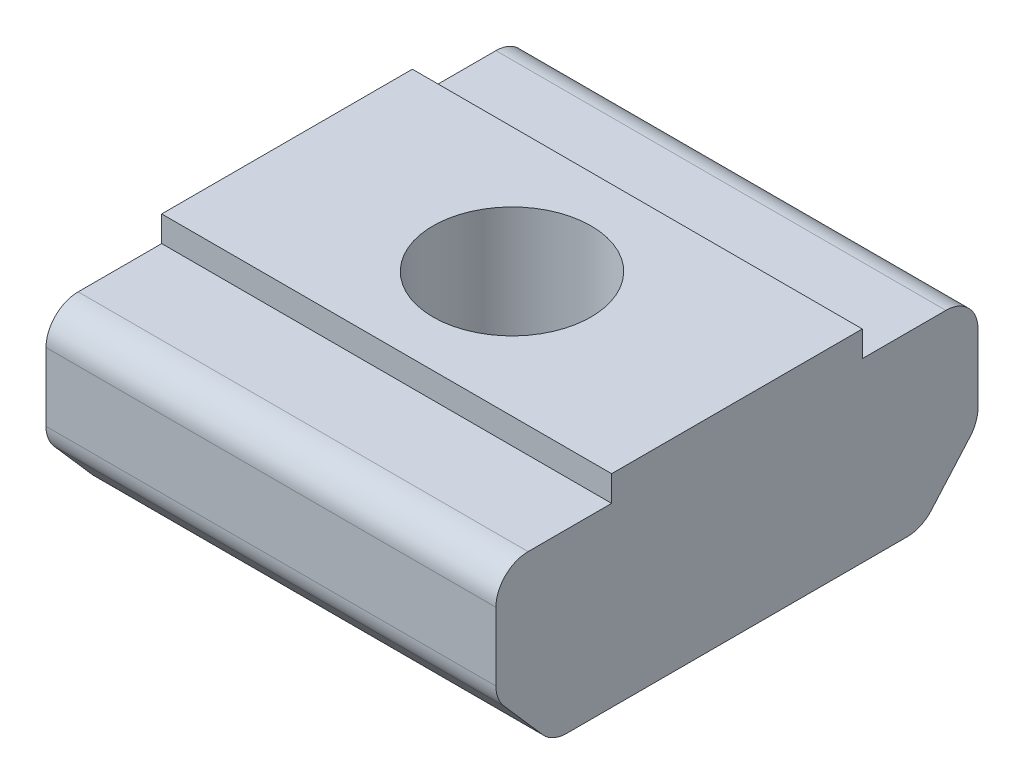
from build123d import *

# Parameters (mm, degrees)
BOSS_EXTRUDE1_DEPTH = 14
FILLET1_R           = 1
TAPPED_HOLE1_D      = 4.917


with BuildPart() as part:
    # Sketch1 → Boss-Extrude1 (new body)
    with BuildSketch(Plane(origin=(-7, 0, 0), x_dir=(0, 0, -1), z_dir=(1, 0, 0))):
        Polygon((5.75, -6.3), (-5.75, -6.3), (-7.5, -4.3), (-7.5, -0.8), (-3.9, -0.8), (-3.9, 0), (3.9, 0), (3.9, -0.8), (7.5, -0.8), (7.5, -4.3), align=None)
    extrude(amount=BOSS_EXTRUDE1_DEPTH)

    # Fillet1
    fillet1_edges = [part.edges().sort_by_distance(p)[0] for p in [
        (0, -0.8, -7.5),
        (0, -4.3, -7.5),
        (0, -6.3, -5.75),
        (0, -6.3, 5.75),
        (0, -4.3, 7.5),
        (0, -0.8, 7.5),
    ]]
    fillet(fillet1_edges, radius=FILLET1_R)

    # Tapped Hole1 (through all)
    with Locations(Plane(origin=(0, 0, 0), x_dir=(1, 0, 0), z_dir=(0, 1, 0))):
        with Locations((0, 0)):
            Hole(TAPPED_HOLE1_D / 2)


solid = part.part
